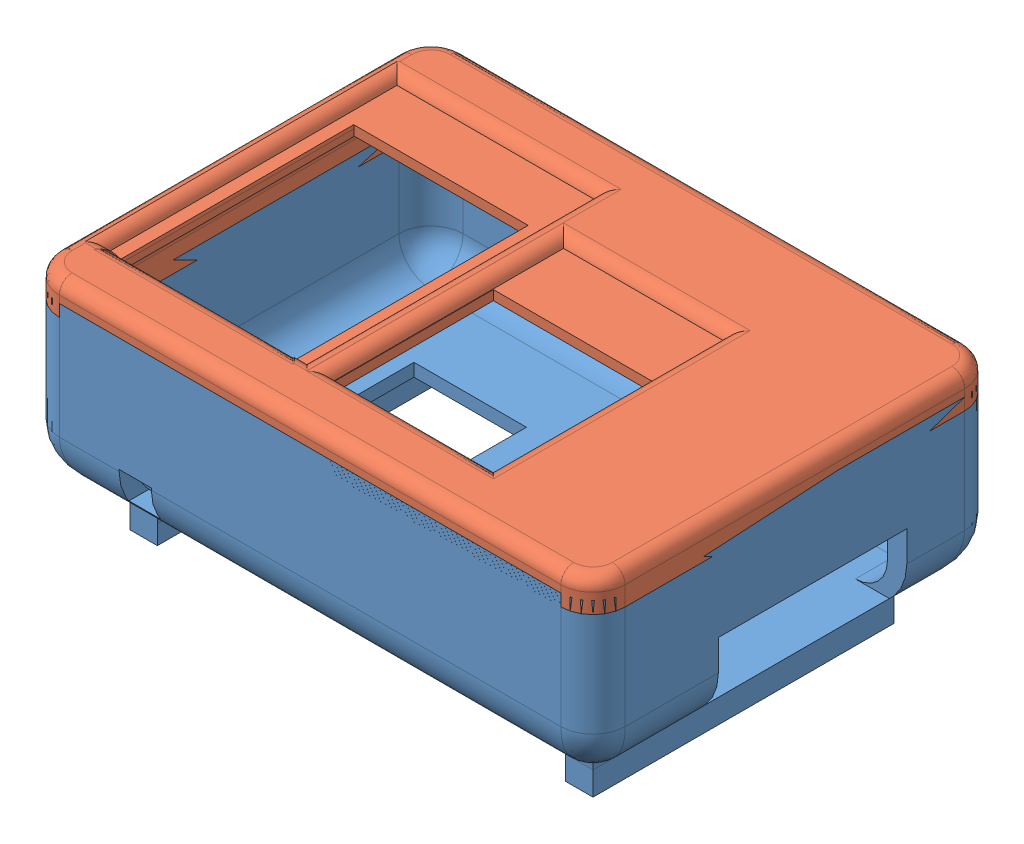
SolidWorks assembly Assem1.sldasm, configuration Default (file format 14000). Lengths in mm.
Overall size (88 36.12 62.8).
2 component instances, 2 part files, 2 mates.
Components (placement in the parent):
- Bottom Part-1: Bottom Part.SLDPRT [Default] at (52.6373 27.0667 69.9158) size (88 33 62.8)
- Top Part-1: Top Part.SLDPRT [Default] at (44.8693 46.1864 69.5158) size (88 10 62.8)
Mates (geometry in assembly coordinates):
- Coincident6: coincident aligned: plane of Bottom Part-1 through (1.8693 53.0667 100.9158) normal (0 0 1); plane of Top Part-1 through (1.8693 53.1864 100.9158) normal (0 0 1)
- Coincident7: coincident: line of Bottom Part-1 through (1.8693 39.8266 52.1178) axis (0 0 1); plane of Top Part-1 through (1.8693 53.1864 100.9158) normal (-1 0 0)
